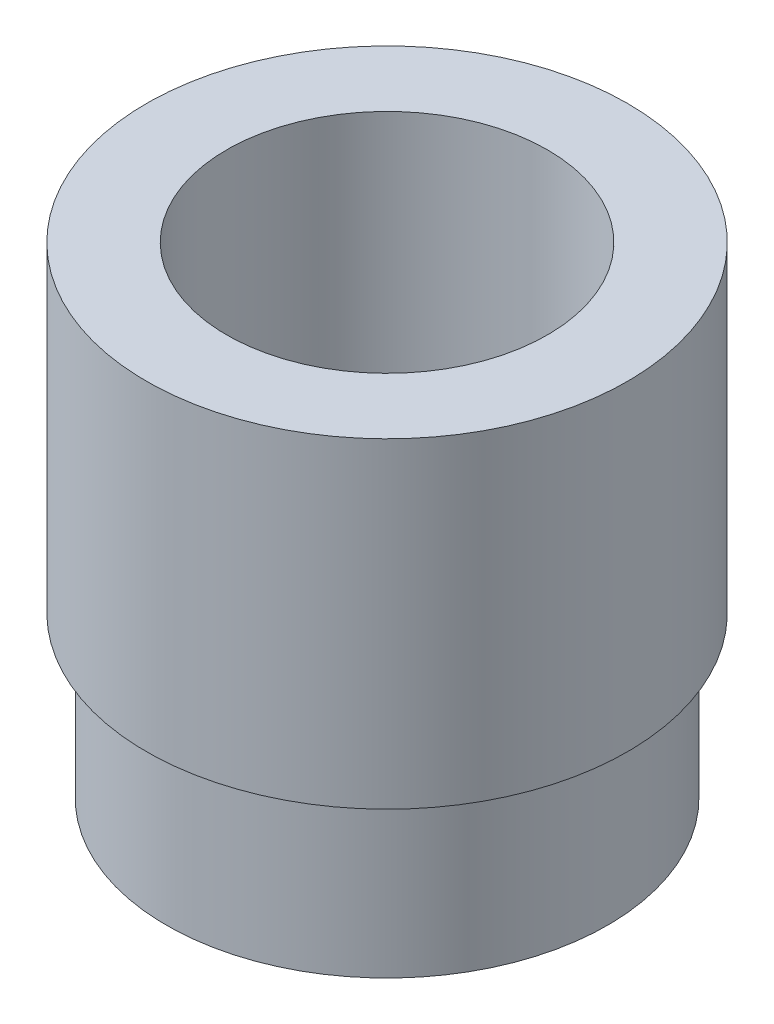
from build123d import *


with BuildPart() as part:
    # Sketch1 → Revolve1 (revolve)
    with BuildSketch(Plane(origin=(0, 0, 0), x_dir=(0, 0, -1), z_dir=(1, 0, 0))):
        Polygon((19.05, 25.4), (19.05, 0), (17.4625, 0), (17.4625, -12.7), (12.7, -12.7), (12.7, 25.4), align=None)
    revolve(axis=Axis((0, 0, 0), (0, 1, 0)))


solid = part.part
